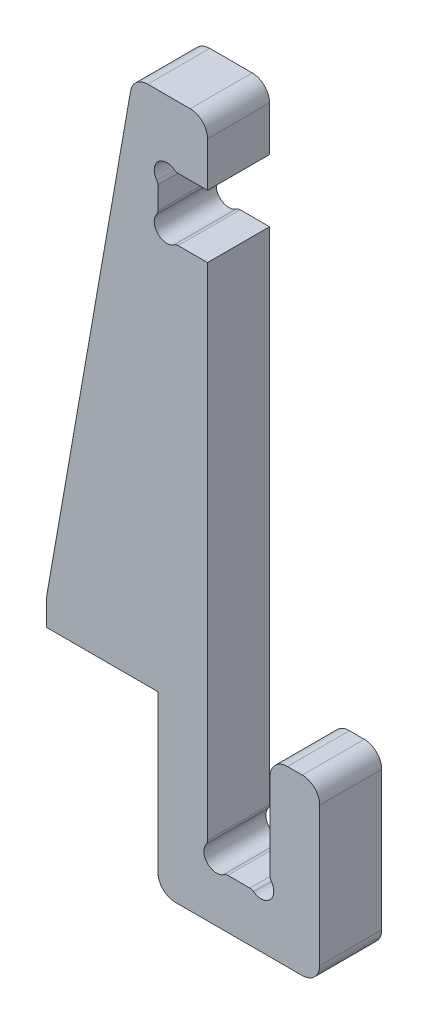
ISO-10303-21;
HEADER;
FILE_DESCRIPTION(('STEP AP214'),'2;1');
FILE_NAME('part.step','',(''),(''),'','','');
FILE_SCHEMA(('AUTOMOTIVE_DESIGN { 1 0 10303 214 1 1 1 1 }'));
ENDSEC;
DATA;
#1=APPLICATION_CONTEXT('core data for automotive mechanical design processes');
#2=APPLICATION_PROTOCOL_DEFINITION('international standard','automotive_design',2000,#1);
#3=PRODUCT_CONTEXT('',#1,'mechanical');
#4=PRODUCT('Part','Part','',(#3));
#5=PRODUCT_RELATED_PRODUCT_CATEGORY('part','',(#4));
#6=PRODUCT_DEFINITION_FORMATION('','',#4);
#7=PRODUCT_DEFINITION_CONTEXT('part definition',#1,'design');
#8=PRODUCT_DEFINITION('design','',#6,#7);
#9=PRODUCT_DEFINITION_SHAPE('','',#8);
#10=(LENGTH_UNIT() NAMED_UNIT(*) SI_UNIT(.MILLI.,.METRE.));
#11=(NAMED_UNIT(*) PLANE_ANGLE_UNIT() SI_UNIT($,.RADIAN.));
#12=(NAMED_UNIT(*) SI_UNIT($,.STERADIAN.) SOLID_ANGLE_UNIT());
#13=UNCERTAINTY_MEASURE_WITH_UNIT(LENGTH_MEASURE(1.E-05),#10,'distance_accuracy_value','');
#14=(GEOMETRIC_REPRESENTATION_CONTEXT(3) GLOBAL_UNCERTAINTY_ASSIGNED_CONTEXT((#13)) GLOBAL_UNIT_ASSIGNED_CONTEXT((#10,
#11,#12)) REPRESENTATION_CONTEXT('',''));
#15=CARTESIAN_POINT('',(0.,0.,0.));
#16=DIRECTION('',(0.,0.,1.));
#17=DIRECTION('',(1.,0.,0.));
#18=AXIS2_PLACEMENT_3D('',#15,#16,#17);
#19=CARTESIAN_POINT('',(17.5,28.1310403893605,25.));
#20=DIRECTION('',(0.,0.,-1.));
#21=DIRECTION('',(-1.,0.,0.));
#22=AXIS2_PLACEMENT_3D('',#19,#20,#21);
#23=CYLINDRICAL_SURFACE('',#22,2.5);
#24=CARTESIAN_POINT('',(17.5,28.1310403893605,0.));
#25=DIRECTION('',(0.,0.,1.));
#26=DIRECTION('',(1.,0.,0.));
#27=AXIS2_PLACEMENT_3D('',#24,#25,#26);
#28=CIRCLE('',#27,2.5);
#29=CARTESIAN_POINT('',(19.508633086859,26.6426207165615,0.));
#30=VERTEX_POINT('',#29);
#31=CARTESIAN_POINT('',(20.,28.1310403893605,0.));
#32=VERTEX_POINT('',#31);
#33=EDGE_CURVE('E273',#30,#32,#28,.T.);
#34=ORIENTED_EDGE('',*,*,#33,.T.);
#35=DIRECTION('',(0.,0.,-1.));
#36=VECTOR('',#35,1.);
#37=CARTESIAN_POINT('',(20.,28.1310403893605,25.));
#38=LINE('',#37,#36);
#39=CARTESIAN_POINT('',(20.,28.1310403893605,25.));
#40=VERTEX_POINT('',#39);
#41=EDGE_CURVE('E254',#40,#32,#38,.T.);
#42=ORIENTED_EDGE('',*,*,#41,.F.);
#43=CARTESIAN_POINT('',(17.5,28.1310403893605,25.));
#44=DIRECTION('',(0.,0.,1.));
#45=DIRECTION('',(1.,0.,0.));
#46=AXIS2_PLACEMENT_3D('',#43,#44,#45);
#47=CIRCLE('',#46,2.5);
#48=CARTESIAN_POINT('',(19.508633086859,26.6426207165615,25.));
#49=VERTEX_POINT('',#48);
#50=EDGE_CURVE('E260',#49,#40,#47,.T.);
#51=ORIENTED_EDGE('',*,*,#50,.F.);
#52=DIRECTION('',(0.,0.,-1.));
#53=VECTOR('',#52,1.);
#54=CARTESIAN_POINT('',(19.508633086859,26.6426207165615,25.));
#55=LINE('',#54,#53);
#56=EDGE_CURVE('E391',#49,#30,#55,.T.);
#57=ORIENTED_EDGE('',*,*,#56,.T.);
#58=EDGE_LOOP('',(#34,#42,#51,#57));
#59=FACE_BOUND('',#58,.T.);
#60=ADVANCED_FACE('F33',(#59),#23,.T.);
#61=CARTESIAN_POINT('',(20.,229.8,25.));
#62=DIRECTION('',(-1.,0.,0.));
#63=DIRECTION('',(0.,-1.,0.));
#64=AXIS2_PLACEMENT_3D('',#61,#62,#63);
#65=PLANE('',#64);
#66=DIRECTION('',(0.,1.,0.));
#67=VECTOR('',#66,1.);
#68=CARTESIAN_POINT('',(20.,229.8,0.));
#69=LINE('',#68,#67);
#70=CARTESIAN_POINT('',(20.,229.8,0.));
#71=VERTEX_POINT('',#70);
#72=EDGE_CURVE('E460',#32,#71,#69,.T.);
#73=ORIENTED_EDGE('',*,*,#72,.T.);
#74=DIRECTION('',(0.,0.,-1.));
#75=VECTOR('',#74,1.);
#76=CARTESIAN_POINT('',(20.,229.8,25.));
#77=LINE('',#76,#75);
#78=CARTESIAN_POINT('',(20.,229.8,25.));
#79=VERTEX_POINT('',#78);
#80=EDGE_CURVE('E257',#79,#71,#77,.T.);
#81=ORIENTED_EDGE('',*,*,#80,.F.);
#82=DIRECTION('',(0.,1.,0.));
#83=VECTOR('',#82,1.);
#84=CARTESIAN_POINT('',(20.,229.8,25.));
#85=LINE('',#84,#83);
#86=EDGE_CURVE('E250',#40,#79,#85,.T.);
#87=ORIENTED_EDGE('',*,*,#86,.F.);
#88=ORIENTED_EDGE('',*,*,#41,.T.);
#89=EDGE_LOOP('',(#73,#81,#87,#88));
#90=FACE_BOUND('',#89,.T.);
#91=ADVANCED_FACE('F252',(#90),#65,.F.);
#92=CARTESIAN_POINT('',(20.,229.8,25.));
#93=DIRECTION('',(0.,-1.,0.));
#94=DIRECTION('',(0.,0.,-1.));
#95=AXIS2_PLACEMENT_3D('',#92,#93,#94);
#96=PLANE('',#95);
#97=DIRECTION('',(-1.,0.,0.));
#98=VECTOR('',#97,1.);
#99=CARTESIAN_POINT('',(20.,229.8,0.));
#100=LINE('',#99,#98);
#101=CARTESIAN_POINT('',(8.13104038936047,229.8,0.));
#102=VERTEX_POINT('',#101);
#103=EDGE_CURVE('E454',#71,#102,#100,.T.);
#104=ORIENTED_EDGE('',*,*,#103,.T.);
#105=DIRECTION('',(0.,0.,-1.));
#106=VECTOR('',#105,1.);
#107=CARTESIAN_POINT('',(8.13104038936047,229.8,25.));
#108=LINE('',#107,#106);
#109=CARTESIAN_POINT('',(8.13104038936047,229.8,25.));
#110=VERTEX_POINT('',#109);
#111=EDGE_CURVE('E279',#110,#102,#108,.T.);
#112=ORIENTED_EDGE('',*,*,#111,.F.);
#113=DIRECTION('',(-1.,0.,0.));
#114=VECTOR('',#113,1.);
#115=CARTESIAN_POINT('',(20.,229.8,25.));
#116=LINE('',#115,#114);
#117=EDGE_CURVE('E259',#79,#110,#116,.T.);
#118=ORIENTED_EDGE('',*,*,#117,.F.);
#119=ORIENTED_EDGE('',*,*,#80,.T.);
#120=EDGE_LOOP('',(#104,#112,#118,#119));
#121=FACE_BOUND('',#120,.T.);
#122=ADVANCED_FACE('F548',(#121),#96,.F.);
#123=CARTESIAN_POINT('',(8.13104038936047,227.3,25.));
#124=DIRECTION('',(0.,0.,-1.));
#125=DIRECTION('',(-1.,0.,0.));
#126=AXIS2_PLACEMENT_3D('',#123,#124,#125);
#127=CYLINDRICAL_SURFACE('',#126,2.49999999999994);
#128=CARTESIAN_POINT('',(8.13104038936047,227.3,0.));
#129=DIRECTION('',(0.,0.,1.));
#130=DIRECTION('',(-1.,0.,0.));
#131=AXIS2_PLACEMENT_3D('',#128,#129,#130);
#132=CIRCLE('',#131,2.49999999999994);
#133=CARTESIAN_POINT('',(6.64262071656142,229.308633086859,0.));
#134=VERTEX_POINT('',#133);
#135=EDGE_CURVE('E449',#102,#134,#132,.T.);
#136=ORIENTED_EDGE('',*,*,#135,.T.);
#137=DIRECTION('',(0.,0.,-1.));
#138=VECTOR('',#137,1.);
#139=CARTESIAN_POINT('',(6.64262071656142,229.308633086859,25.));
#140=LINE('',#139,#138);
#141=CARTESIAN_POINT('',(6.64262071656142,229.308633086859,25.));
#142=VERTEX_POINT('',#141);
#143=EDGE_CURVE('E440',#142,#134,#140,.T.);
#144=ORIENTED_EDGE('',*,*,#143,.F.);
#145=CARTESIAN_POINT('',(8.13104038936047,227.3,25.));
#146=DIRECTION('',(0.,0.,1.));
#147=DIRECTION('',(-1.,0.,0.));
#148=AXIS2_PLACEMENT_3D('',#145,#146,#147);
#149=CIRCLE('',#148,2.49999999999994);
#150=EDGE_CURVE('E450',#110,#142,#149,.T.);
#151=ORIENTED_EDGE('',*,*,#150,.F.);
#152=ORIENTED_EDGE('',*,*,#111,.T.);
#153=EDGE_LOOP('',(#136,#144,#151,#152));
#154=FACE_BOUND('',#153,.T.);
#155=ADVANCED_FACE('F447',(#154),#127,.T.);
#156=CARTESIAN_POINT('',(3.60624458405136,233.406244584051,25.));
#157=DIRECTION('',(0.,0.,-1.));
#158=DIRECTION('',(-1.,0.,0.));
#159=AXIS2_PLACEMENT_3D('',#156,#157,#158);
#160=CYLINDRICAL_SURFACE('',#159,5.10000000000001);
#161=CARTESIAN_POINT('',(3.60624458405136,233.406244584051,0.));
#162=DIRECTION('',(0.,0.,-1.));
#163=DIRECTION('',(-1.,0.,0.));
#164=AXIS2_PLACEMENT_3D('',#161,#162,#163);
#165=CIRCLE('',#164,5.10000000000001);
#166=CARTESIAN_POINT('',(-0.49136691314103,236.442620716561,0.));
#167=VERTEX_POINT('',#166);
#168=EDGE_CURVE('E456',#134,#167,#165,.T.);
#169=ORIENTED_EDGE('',*,*,#168,.T.);
#170=DIRECTION('',(0.,0.,-1.));
#171=VECTOR('',#170,1.);
#172=CARTESIAN_POINT('',(-0.49136691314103,236.442620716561,25.));
#173=LINE('',#172,#171);
#174=CARTESIAN_POINT('',(-0.49136691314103,236.442620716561,25.));
#175=VERTEX_POINT('',#174);
#176=EDGE_CURVE('E437',#175,#167,#173,.T.);
#177=ORIENTED_EDGE('',*,*,#176,.F.);
#178=CARTESIAN_POINT('',(3.60624458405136,233.406244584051,25.));
#179=DIRECTION('',(0.,0.,-1.));
#180=DIRECTION('',(-1.,0.,0.));
#181=AXIS2_PLACEMENT_3D('',#178,#179,#180);
#182=CIRCLE('',#181,5.10000000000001);
#183=EDGE_CURVE('E508',#142,#175,#182,.T.);
#184=ORIENTED_EDGE('',*,*,#183,.F.);
#185=ORIENTED_EDGE('',*,*,#143,.T.);
#186=EDGE_LOOP('',(#169,#177,#184,#185));
#187=FACE_BOUND('',#186,.T.);
#188=ADVANCED_FACE('F507',(#187),#160,.F.);
#189=CARTESIAN_POINT('',(-2.50000000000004,237.931040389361,25.));
#190=DIRECTION('',(0.,0.,-1.));
#191=DIRECTION('',(-1.,0.,0.));
#192=AXIS2_PLACEMENT_3D('',#189,#190,#191);
#193=CYLINDRICAL_SURFACE('',#192,2.5);
#194=CARTESIAN_POINT('',(-2.50000000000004,237.931040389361,0.));
#195=DIRECTION('',(0.,0.,1.));
#196=DIRECTION('',(1.,0.,0.));
#197=AXIS2_PLACEMENT_3D('',#194,#195,#196);
#198=CIRCLE('',#197,2.5);
#199=CARTESIAN_POINT('',(0.,237.931040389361,0.));
#200=VERTEX_POINT('',#199);
#201=EDGE_CURVE('E458',#167,#200,#198,.T.);
#202=ORIENTED_EDGE('',*,*,#201,.T.);
#203=DIRECTION('',(0.,0.,-1.));
#204=VECTOR('',#203,1.);
#205=CARTESIAN_POINT('',(0.,237.931040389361,25.));
#206=LINE('',#205,#204);
#207=CARTESIAN_POINT('',(0.,237.931040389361,25.));
#208=VERTEX_POINT('',#207);
#209=EDGE_CURVE('E434',#208,#200,#206,.T.);
#210=ORIENTED_EDGE('',*,*,#209,.F.);
#211=CARTESIAN_POINT('',(-2.50000000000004,237.931040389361,25.));
#212=DIRECTION('',(0.,0.,1.));
#213=DIRECTION('',(1.,0.,0.));
#214=AXIS2_PLACEMENT_3D('',#211,#212,#213);
#215=CIRCLE('',#214,2.5);
#216=EDGE_CURVE('E503',#175,#208,#215,.T.);
#217=ORIENTED_EDGE('',*,*,#216,.F.);
#218=ORIENTED_EDGE('',*,*,#176,.T.);
#219=EDGE_LOOP('',(#202,#210,#217,#218));
#220=FACE_BOUND('',#219,.T.);
#221=ADVANCED_FACE('F502',(#220),#193,.T.);
#222=CARTESIAN_POINT('',(0.,246.868959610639,25.));
#223=DIRECTION('',(-1.,0.,0.));
#224=DIRECTION('',(0.,0.,1.));
#225=AXIS2_PLACEMENT_3D('',#222,#223,#224);
#226=PLANE('',#225);
#227=DIRECTION('',(0.,1.,0.));
#228=VECTOR('',#227,1.);
#229=CARTESIAN_POINT('',(0.,246.868959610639,0.));
#230=LINE('',#229,#228);
#231=CARTESIAN_POINT('',(0.,246.868959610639,0.));
#232=VERTEX_POINT('',#231);
#233=EDGE_CURVE('E465',#200,#232,#230,.T.);
#234=ORIENTED_EDGE('',*,*,#233,.T.);
#235=DIRECTION('',(0.,0.,-1.));
#236=VECTOR('',#235,1.);
#237=CARTESIAN_POINT('',(0.,246.868959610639,25.));
#238=LINE('',#237,#236);
#239=CARTESIAN_POINT('',(0.,246.868959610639,25.));
#240=VERTEX_POINT('',#239);
#241=EDGE_CURVE('E431',#240,#232,#238,.T.);
#242=ORIENTED_EDGE('',*,*,#241,.F.);
#243=DIRECTION('',(0.,1.,0.));
#244=VECTOR('',#243,1.);
#245=CARTESIAN_POINT('',(0.,246.868959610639,25.));
#246=LINE('',#245,#244);
#247=EDGE_CURVE('E499',#208,#240,#246,.T.);
#248=ORIENTED_EDGE('',*,*,#247,.F.);
#249=ORIENTED_EDGE('',*,*,#209,.T.);
#250=EDGE_LOOP('',(#234,#242,#248,#249));
#251=FACE_BOUND('',#250,.T.);
#252=ADVANCED_FACE('F496',(#251),#226,.F.);
#253=CARTESIAN_POINT('',(-2.50000000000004,246.868959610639,25.));
#254=DIRECTION('',(0.,0.,-1.));
#255=DIRECTION('',(-1.,0.,0.));
#256=AXIS2_PLACEMENT_3D('',#253,#254,#255);
#257=CYLINDRICAL_SURFACE('',#256,2.5);
#258=CARTESIAN_POINT('',(-2.50000000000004,246.868959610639,0.));
#259=DIRECTION('',(0.,0.,1.));
#260=DIRECTION('',(-1.,0.,0.));
#261=AXIS2_PLACEMENT_3D('',#258,#259,#260);
#262=CIRCLE('',#261,2.5);
#263=CARTESIAN_POINT('',(-0.491366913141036,248.357379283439,0.));
#264=VERTEX_POINT('',#263);
#265=EDGE_CURVE('E467',#232,#264,#262,.T.);
#266=ORIENTED_EDGE('',*,*,#265,.T.);
#267=DIRECTION('',(0.,0.,-1.));
#268=VECTOR('',#267,1.);
#269=CARTESIAN_POINT('',(-0.491366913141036,248.357379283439,25.));
#270=LINE('',#269,#268);
#271=CARTESIAN_POINT('',(-0.491366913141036,248.357379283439,25.));
#272=VERTEX_POINT('',#271);
#273=EDGE_CURVE('E428',#272,#264,#270,.T.);
#274=ORIENTED_EDGE('',*,*,#273,.F.);
#275=CARTESIAN_POINT('',(-2.50000000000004,246.868959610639,25.));
#276=DIRECTION('',(0.,0.,1.));
#277=DIRECTION('',(-1.,0.,0.));
#278=AXIS2_PLACEMENT_3D('',#275,#276,#277);
#279=CIRCLE('',#278,2.5);
#280=EDGE_CURVE('E492',#240,#272,#279,.T.);
#281=ORIENTED_EDGE('',*,*,#280,.F.);
#282=ORIENTED_EDGE('',*,*,#241,.T.);
#283=EDGE_LOOP('',(#266,#274,#281,#282));
#284=FACE_BOUND('',#283,.T.);
#285=ADVANCED_FACE('F491',(#284),#257,.T.);
#286=CARTESIAN_POINT('',(3.60624458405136,251.393755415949,25.));
#287=DIRECTION('',(0.,0.,-1.));
#288=DIRECTION('',(-1.,0.,0.));
#289=AXIS2_PLACEMENT_3D('',#286,#287,#288);
#290=CYLINDRICAL_SURFACE('',#289,5.10000000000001);
#291=CARTESIAN_POINT('',(3.60624458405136,251.393755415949,0.));
#292=DIRECTION('',(0.,0.,-1.));
#293=DIRECTION('',(1.,0.,0.));
#294=AXIS2_PLACEMENT_3D('',#291,#292,#293);
#295=CIRCLE('',#294,5.10000000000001);
#296=CARTESIAN_POINT('',(6.64262071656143,255.491366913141,0.));
#297=VERTEX_POINT('',#296);
#298=EDGE_CURVE('E469',#264,#297,#295,.T.);
#299=ORIENTED_EDGE('',*,*,#298,.T.);
#300=DIRECTION('',(0.,0.,-1.));
#301=VECTOR('',#300,1.);
#302=CARTESIAN_POINT('',(6.64262071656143,255.491366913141,25.));
#303=LINE('',#302,#301);
#304=CARTESIAN_POINT('',(6.64262071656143,255.491366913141,25.));
#305=VERTEX_POINT('',#304);
#306=EDGE_CURVE('E425',#305,#297,#303,.T.);
#307=ORIENTED_EDGE('',*,*,#306,.F.);
#308=CARTESIAN_POINT('',(3.60624458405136,251.393755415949,25.));
#309=DIRECTION('',(0.,0.,-1.));
#310=DIRECTION('',(1.,0.,0.));
#311=AXIS2_PLACEMENT_3D('',#308,#309,#310);
#312=CIRCLE('',#311,5.10000000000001);
#313=EDGE_CURVE('E487',#272,#305,#312,.T.);
#314=ORIENTED_EDGE('',*,*,#313,.F.);
#315=ORIENTED_EDGE('',*,*,#273,.T.);
#316=EDGE_LOOP('',(#299,#307,#314,#315));
#317=FACE_BOUND('',#316,.T.);
#318=ADVANCED_FACE('F486',(#317),#290,.F.);
#319=CARTESIAN_POINT('',(8.13104038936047,257.5,25.));
#320=DIRECTION('',(0.,0.,-1.));
#321=DIRECTION('',(-1.,0.,0.));
#322=AXIS2_PLACEMENT_3D('',#319,#320,#321);
#323=CYLINDRICAL_SURFACE('',#322,2.49999999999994);
#324=CARTESIAN_POINT('',(8.13104038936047,257.5,0.));
#325=DIRECTION('',(0.,0.,1.));
#326=DIRECTION('',(1.,0.,0.));
#327=AXIS2_PLACEMENT_3D('',#324,#325,#326);
#328=CIRCLE('',#327,2.49999999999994);
#329=CARTESIAN_POINT('',(8.13104038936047,255.,0.));
#330=VERTEX_POINT('',#329);
#331=EDGE_CURVE('E471',#297,#330,#328,.T.);
#332=ORIENTED_EDGE('',*,*,#331,.T.);
#333=DIRECTION('',(0.,0.,-1.));
#334=VECTOR('',#333,1.);
#335=CARTESIAN_POINT('',(8.13104038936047,255.,25.));
#336=LINE('',#335,#334);
#337=CARTESIAN_POINT('',(8.13104038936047,255.,25.));
#338=VERTEX_POINT('',#337);
#339=EDGE_CURVE('E422',#338,#330,#336,.T.);
#340=ORIENTED_EDGE('',*,*,#339,.F.);
#341=CARTESIAN_POINT('',(8.13104038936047,257.5,25.));
#342=DIRECTION('',(0.,0.,1.));
#343=DIRECTION('',(1.,0.,0.));
#344=AXIS2_PLACEMENT_3D('',#341,#342,#343);
#345=CIRCLE('',#344,2.49999999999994);
#346=EDGE_CURVE('E483',#305,#338,#345,.T.);
#347=ORIENTED_EDGE('',*,*,#346,.F.);
#348=ORIENTED_EDGE('',*,*,#306,.T.);
#349=EDGE_LOOP('',(#332,#340,#347,#348));
#350=FACE_BOUND('',#349,.T.);
#351=ADVANCED_FACE('F480',(#350),#323,.T.);
#352=CARTESIAN_POINT('',(20.,255.,25.));
#353=DIRECTION('',(0.,1.,0.));
#354=DIRECTION('',(0.,0.,1.));
#355=AXIS2_PLACEMENT_3D('',#352,#353,#354);
#356=PLANE('',#355);
#357=DIRECTION('',(1.,0.,0.));
#358=VECTOR('',#357,1.);
#359=CARTESIAN_POINT('',(20.,255.,0.));
#360=LINE('',#359,#358);
#361=CARTESIAN_POINT('',(20.,255.,0.));
#362=VERTEX_POINT('',#361);
#363=EDGE_CURVE('E360',#330,#362,#360,.T.);
#364=ORIENTED_EDGE('',*,*,#363,.T.);
#365=DIRECTION('',(0.,0.,-1.));
#366=VECTOR('',#365,1.);
#367=CARTESIAN_POINT('',(20.,255.,25.));
#368=LINE('',#367,#366);
#369=CARTESIAN_POINT('',(20.,255.,25.));
#370=VERTEX_POINT('',#369);
#371=EDGE_CURVE('E420',#370,#362,#368,.T.);
#372=ORIENTED_EDGE('',*,*,#371,.F.);
#373=DIRECTION('',(1.,0.,0.));
#374=VECTOR('',#373,1.);
#375=CARTESIAN_POINT('',(20.,255.,25.));
#376=LINE('',#375,#374);
#377=EDGE_CURVE('E340',#338,#370,#376,.T.);
#378=ORIENTED_EDGE('',*,*,#377,.F.);
#379=ORIENTED_EDGE('',*,*,#339,.T.);
#380=EDGE_LOOP('',(#364,#372,#378,#379));
#381=FACE_BOUND('',#380,.T.);
#382=ADVANCED_FACE('F474',(#381),#356,.F.);
#383=CARTESIAN_POINT('',(20.,280.,25.));
#384=DIRECTION('',(-1.,0.,0.));
#385=DIRECTION('',(0.,0.,1.));
#386=AXIS2_PLACEMENT_3D('',#383,#384,#385);
#387=PLANE('',#386);
#388=DIRECTION('',(0.,1.,0.));
#389=VECTOR('',#388,1.);
#390=CARTESIAN_POINT('',(20.,280.,0.));
#391=LINE('',#390,#389);
#392=CARTESIAN_POINT('',(20.,273.,0.));
#393=VERTEX_POINT('',#392);
#394=EDGE_CURVE('E334',#362,#393,#391,.T.);
#395=ORIENTED_EDGE('',*,*,#394,.T.);
#396=DIRECTION('',(0.,0.,-1.));
#397=VECTOR('',#396,1.);
#398=CARTESIAN_POINT('',(20.,273.,25.));
#399=LINE('',#398,#397);
#400=CARTESIAN_POINT('',(20.,273.,25.));
#401=VERTEX_POINT('',#400);
#402=EDGE_CURVE('E41',#393,#401,#399,.F.);
#403=ORIENTED_EDGE('',*,*,#402,.T.);
#404=DIRECTION('',(0.,1.,0.));
#405=VECTOR('',#404,1.);
#406=CARTESIAN_POINT('',(20.,280.,25.));
#407=LINE('',#406,#405);
#408=EDGE_CURVE('E332',#370,#401,#407,.T.);
#409=ORIENTED_EDGE('',*,*,#408,.F.);
#410=ORIENTED_EDGE('',*,*,#371,.T.);
#411=EDGE_LOOP('',(#395,#403,#409,#410));
#412=FACE_BOUND('',#411,.T.);
#413=ADVANCED_FACE('F330',(#412),#387,.F.);
#414=CARTESIAN_POINT('',(-10.,280.,25.));
#415=DIRECTION('',(0.,-1.,0.));
#416=DIRECTION('',(0.,0.,-1.));
#417=AXIS2_PLACEMENT_3D('',#414,#415,#416);
#418=PLANE('',#417);
#419=DIRECTION('',(-1.,0.,0.));
#420=VECTOR('',#419,1.);
#421=CARTESIAN_POINT('',(-10.,280.,25.));
#422=LINE('',#421,#420);
#423=CARTESIAN_POINT('',(13.,280.,25.));
#424=VERTEX_POINT('',#423);
#425=CARTESIAN_POINT('',(-4.11862082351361,280.,25.));
#426=VERTEX_POINT('',#425);
#427=EDGE_CURVE('E342',#424,#426,#422,.T.);
#428=ORIENTED_EDGE('',*,*,#427,.F.);
#429=DIRECTION('',(0.,0.,-1.));
#430=VECTOR('',#429,1.);
#431=CARTESIAN_POINT('',(13.,280.,25.));
#432=LINE('',#431,#430);
#433=CARTESIAN_POINT('',(13.,280.,0.));
#434=VERTEX_POINT('',#433);
#435=EDGE_CURVE('E323',#424,#434,#432,.T.);
#436=ORIENTED_EDGE('',*,*,#435,.T.);
#437=DIRECTION('',(-1.,0.,0.));
#438=VECTOR('',#437,1.);
#439=CARTESIAN_POINT('',(-10.,280.,0.));
#440=LINE('',#439,#438);
#441=CARTESIAN_POINT('',(-4.11862082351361,280.,0.));
#442=VERTEX_POINT('',#441);
#443=EDGE_CURVE('E350',#434,#442,#440,.T.);
#444=ORIENTED_EDGE('',*,*,#443,.T.);
#445=DIRECTION('',(0.,0.,-1.));
#446=VECTOR('',#445,1.);
#447=CARTESIAN_POINT('',(-4.11862082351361,280.,25.));
#448=LINE('',#447,#446);
#449=EDGE_CURVE('E321',#442,#426,#448,.F.);
#450=ORIENTED_EDGE('',*,*,#449,.T.);
#451=EDGE_LOOP('',(#428,#436,#444,#450));
#452=FACE_BOUND('',#451,.T.);
#453=ADVANCED_FACE('F349',(#452),#418,.F.);
#454=CARTESIAN_POINT('',(-45.,80.,25.));
#455=DIRECTION('',(0.985030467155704,-0.172380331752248,0.));
#456=DIRECTION('',(0.172380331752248,0.985030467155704,0.));
#457=AXIS2_PLACEMENT_3D('',#454,#455,#456);
#458=PLANE('',#457);
#459=DIRECTION('',(-0.172380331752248,-0.985030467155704,0.));
#460=VECTOR('',#459,1.);
#461=CARTESIAN_POINT('',(-45.,80.,25.));
#462=LINE('',#461,#460);
#463=CARTESIAN_POINT('',(-11.0138340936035,274.206662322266,25.));
#464=VERTEX_POINT('',#463);
#465=CARTESIAN_POINT('',(-45.,80.,25.));
#466=VERTEX_POINT('',#465);
#467=EDGE_CURVE('E520',#464,#466,#462,.T.);
#468=ORIENTED_EDGE('',*,*,#467,.F.);
#469=DIRECTION('',(0.,0.,-1.));
#470=VECTOR('',#469,1.);
#471=CARTESIAN_POINT('',(-11.0138340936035,274.206662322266,25.));
#472=LINE('',#471,#470);
#473=CARTESIAN_POINT('',(-11.0138340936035,274.206662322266,0.));
#474=VERTEX_POINT('',#473);
#475=EDGE_CURVE('E11',#464,#474,#472,.T.);
#476=ORIENTED_EDGE('',*,*,#475,.T.);
#477=DIRECTION('',(-0.172380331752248,-0.985030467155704,0.));
#478=VECTOR('',#477,1.);
#479=CARTESIAN_POINT('',(-45.,80.,0.));
#480=LINE('',#479,#478);
#481=CARTESIAN_POINT('',(-45.,80.,0.));
#482=VERTEX_POINT('',#481);
#483=EDGE_CURVE('E356',#474,#482,#480,.T.);
#484=ORIENTED_EDGE('',*,*,#483,.T.);
#485=DIRECTION('',(0.,0.,-1.));
#486=VECTOR('',#485,1.);
#487=CARTESIAN_POINT('',(-45.,80.,25.));
#488=LINE('',#487,#486);
#489=EDGE_CURVE('E417',#466,#482,#488,.T.);
#490=ORIENTED_EDGE('',*,*,#489,.F.);
#491=EDGE_LOOP('',(#468,#476,#484,#490));
#492=FACE_BOUND('',#491,.T.);
#493=ADVANCED_FACE('F589',(#492),#458,.F.);
#494=CARTESIAN_POINT('',(-45.,70.,25.));
#495=DIRECTION('',(1.,0.,0.));
#496=DIRECTION('',(0.,1.,0.));
#497=AXIS2_PLACEMENT_3D('',#494,#495,#496);
#498=PLANE('',#497);
#499=DIRECTION('',(0.,-1.,0.));
#500=VECTOR('',#499,1.);
#501=CARTESIAN_POINT('',(-45.,70.,0.));
#502=LINE('',#501,#500);
#503=CARTESIAN_POINT('',(-45.,70.,0.));
#504=VERTEX_POINT('',#503);
#505=EDGE_CURVE('E358',#482,#504,#502,.T.);
#506=ORIENTED_EDGE('',*,*,#505,.T.);
#507=DIRECTION('',(0.,0.,-1.));
#508=VECTOR('',#507,1.);
#509=CARTESIAN_POINT('',(-45.,70.,25.));
#510=LINE('',#509,#508);
#511=CARTESIAN_POINT('',(-45.,70.,25.));
#512=VERTEX_POINT('',#511);
#513=EDGE_CURVE('E414',#512,#504,#510,.T.);
#514=ORIENTED_EDGE('',*,*,#513,.F.);
#515=DIRECTION('',(0.,-1.,0.));
#516=VECTOR('',#515,1.);
#517=CARTESIAN_POINT('',(-45.,70.,25.));
#518=LINE('',#517,#516);
#519=EDGE_CURVE('E522',#466,#512,#518,.T.);
#520=ORIENTED_EDGE('',*,*,#519,.F.);
#521=ORIENTED_EDGE('',*,*,#489,.T.);
#522=EDGE_LOOP('',(#506,#514,#520,#521));
#523=FACE_BOUND('',#522,.T.);
#524=ADVANCED_FACE('F594',(#523),#498,.F.);
#525=CARTESIAN_POINT('',(0.,70.,25.));
#526=DIRECTION('',(0.,1.,0.));
#527=DIRECTION('',(0.,0.,1.));
#528=AXIS2_PLACEMENT_3D('',#525,#526,#527);
#529=PLANE('',#528);
#530=DIRECTION('',(1.,0.,0.));
#531=VECTOR('',#530,1.);
#532=CARTESIAN_POINT('',(0.,70.,0.));
#533=LINE('',#532,#531);
#534=CARTESIAN_POINT('',(0.,70.,0.));
#535=VERTEX_POINT('',#534);
#536=EDGE_CURVE('E365',#504,#535,#533,.T.);
#537=ORIENTED_EDGE('',*,*,#536,.T.);
#538=DIRECTION('',(0.,0.,-1.));
#539=VECTOR('',#538,1.);
#540=CARTESIAN_POINT('',(0.,70.,25.));
#541=LINE('',#540,#539);
#542=CARTESIAN_POINT('',(0.,70.,25.));
#543=VERTEX_POINT('',#542);
#544=EDGE_CURVE('E411',#543,#535,#541,.T.);
#545=ORIENTED_EDGE('',*,*,#544,.F.);
#546=DIRECTION('',(1.,0.,0.));
#547=VECTOR('',#546,1.);
#548=CARTESIAN_POINT('',(0.,70.,25.));
#549=LINE('',#548,#547);
#550=EDGE_CURVE('E524',#512,#543,#549,.T.);
#551=ORIENTED_EDGE('',*,*,#550,.F.);
#552=ORIENTED_EDGE('',*,*,#513,.T.);
#553=EDGE_LOOP('',(#537,#545,#551,#552));
#554=FACE_BOUND('',#553,.T.);
#555=ADVANCED_FACE('F600',(#554),#529,.F.);
#556=CARTESIAN_POINT('',(0.,0.,25.));
#557=DIRECTION('',(1.,0.,0.));
#558=DIRECTION('',(0.,1.,0.));
#559=AXIS2_PLACEMENT_3D('',#556,#557,#558);
#560=PLANE('',#559);
#561=DIRECTION('',(0.,-1.,0.));
#562=VECTOR('',#561,1.);
#563=CARTESIAN_POINT('',(0.,0.,0.));
#564=LINE('',#563,#562);
#565=CARTESIAN_POINT('',(0.,7.,0.));
#566=VERTEX_POINT('',#565);
#567=EDGE_CURVE('E367',#535,#566,#564,.T.);
#568=ORIENTED_EDGE('',*,*,#567,.T.);
#569=DIRECTION('',(0.,0.,-1.));
#570=VECTOR('',#569,1.);
#571=CARTESIAN_POINT('',(0.,7.,25.));
#572=LINE('',#571,#570);
#573=CARTESIAN_POINT('',(0.,7.,25.));
#574=VERTEX_POINT('',#573);
#575=EDGE_CURVE('E319',#566,#574,#572,.F.);
#576=ORIENTED_EDGE('',*,*,#575,.T.);
#577=DIRECTION('',(0.,-1.,0.));
#578=VECTOR('',#577,1.);
#579=CARTESIAN_POINT('',(0.,0.,25.));
#580=LINE('',#579,#578);
#581=EDGE_CURVE('E526',#543,#574,#580,.T.);
#582=ORIENTED_EDGE('',*,*,#581,.F.);
#583=ORIENTED_EDGE('',*,*,#544,.T.);
#584=EDGE_LOOP('',(#568,#576,#582,#583));
#585=FACE_BOUND('',#584,.T.);
#586=ADVANCED_FACE('F604',(#585),#560,.F.);
#587=CARTESIAN_POINT('',(65.2,0.,25.));
#588=DIRECTION('',(0.,1.,0.));
#589=DIRECTION('',(-1.,0.,0.));
#590=AXIS2_PLACEMENT_3D('',#587,#588,#589);
#591=PLANE('',#590);
#592=DIRECTION('',(1.,0.,0.));
#593=VECTOR('',#592,1.);
#594=CARTESIAN_POINT('',(65.2,0.,0.));
#595=LINE('',#594,#593);
#596=CARTESIAN_POINT('',(7.,0.,0.));
#597=VERTEX_POINT('',#596);
#598=CARTESIAN_POINT('',(58.2,0.,0.));
#599=VERTEX_POINT('',#598);
#600=EDGE_CURVE('E370',#597,#599,#595,.T.);
#601=ORIENTED_EDGE('',*,*,#600,.T.);
#602=DIRECTION('',(0.,0.,-1.));
#603=VECTOR('',#602,1.);
#604=CARTESIAN_POINT('',(58.2,0.,25.));
#605=LINE('',#604,#603);
#606=CARTESIAN_POINT('',(58.2,0.,25.));
#607=VERTEX_POINT('',#606);
#608=EDGE_CURVE('E317',#599,#607,#605,.F.);
#609=ORIENTED_EDGE('',*,*,#608,.T.);
#610=DIRECTION('',(1.,0.,0.));
#611=VECTOR('',#610,1.);
#612=CARTESIAN_POINT('',(65.2,0.,25.));
#613=LINE('',#612,#611);
#614=CARTESIAN_POINT('',(7.,0.,25.));
#615=VERTEX_POINT('',#614);
#616=EDGE_CURVE('E529',#615,#607,#613,.T.);
#617=ORIENTED_EDGE('',*,*,#616,.F.);
#618=DIRECTION('',(0.,0.,-1.));
#619=VECTOR('',#618,1.);
#620=CARTESIAN_POINT('',(7.,0.,25.));
#621=LINE('',#620,#619);
#622=EDGE_CURVE('E314',#615,#597,#621,.T.);
#623=ORIENTED_EDGE('',*,*,#622,.T.);
#624=EDGE_LOOP('',(#601,#609,#617,#623));
#625=FACE_BOUND('',#624,.T.);
#626=ADVANCED_FACE('F609',(#625),#591,.F.);
#627=CARTESIAN_POINT('',(65.2,70.,25.));
#628=DIRECTION('',(-1.,0.,0.));
#629=DIRECTION('',(0.,-1.,0.));
#630=AXIS2_PLACEMENT_3D('',#627,#628,#629);
#631=PLANE('',#630);
#632=DIRECTION('',(0.,1.,0.));
#633=VECTOR('',#632,1.);
#634=CARTESIAN_POINT('',(65.2,70.,0.));
#635=LINE('',#634,#633);
#636=CARTESIAN_POINT('',(65.2,7.00000000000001,0.));
#637=VERTEX_POINT('',#636);
#638=CARTESIAN_POINT('',(65.2,63.,0.));
#639=VERTEX_POINT('',#638);
#640=EDGE_CURVE('E373',#637,#639,#635,.T.);
#641=ORIENTED_EDGE('',*,*,#640,.T.);
#642=DIRECTION('',(0.,0.,-1.));
#643=VECTOR('',#642,1.);
#644=CARTESIAN_POINT('',(65.2,63.,25.));
#645=LINE('',#644,#643);
#646=CARTESIAN_POINT('',(65.2,63.,25.));
#647=VERTEX_POINT('',#646);
#648=EDGE_CURVE('E48',#639,#647,#645,.F.);
#649=ORIENTED_EDGE('',*,*,#648,.T.);
#650=DIRECTION('',(0.,1.,0.));
#651=VECTOR('',#650,1.);
#652=CARTESIAN_POINT('',(65.2,70.,25.));
#653=LINE('',#652,#651);
#654=CARTESIAN_POINT('',(65.2,7.00000000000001,25.));
#655=VERTEX_POINT('',#654);
#656=EDGE_CURVE('E531',#655,#647,#653,.T.);
#657=ORIENTED_EDGE('',*,*,#656,.F.);
#658=DIRECTION('',(0.,0.,-1.));
#659=VECTOR('',#658,1.);
#660=CARTESIAN_POINT('',(65.2,7.00000000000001,25.));
#661=LINE('',#660,#659);
#662=EDGE_CURVE('E310',#655,#637,#661,.T.);
#663=ORIENTED_EDGE('',*,*,#662,.T.);
#664=EDGE_LOOP('',(#641,#649,#657,#663));
#665=FACE_BOUND('',#664,.T.);
#666=ADVANCED_FACE('F614',(#665),#631,.F.);
#667=CARTESIAN_POINT('',(45.2,70.,25.));
#668=DIRECTION('',(0.,-1.,0.));
#669=DIRECTION('',(1.,0.,0.));
#670=AXIS2_PLACEMENT_3D('',#667,#668,#669);
#671=PLANE('',#670);
#672=DIRECTION('',(-1.,0.,0.));
#673=VECTOR('',#672,1.);
#674=CARTESIAN_POINT('',(45.2,70.,0.));
#675=LINE('',#674,#673);
#676=CARTESIAN_POINT('',(58.2,70.,0.));
#677=VERTEX_POINT('',#676);
#678=CARTESIAN_POINT('',(52.2,70.,0.));
#679=VERTEX_POINT('',#678);
#680=EDGE_CURVE('E375',#677,#679,#675,.T.);
#681=ORIENTED_EDGE('',*,*,#680,.T.);
#682=DIRECTION('',(0.,0.,-1.));
#683=VECTOR('',#682,1.);
#684=CARTESIAN_POINT('',(52.2,70.,25.));
#685=LINE('',#684,#683);
#686=CARTESIAN_POINT('',(52.2,70.,25.));
#687=VERTEX_POINT('',#686);
#688=EDGE_CURVE('E297',#679,#687,#685,.F.);
#689=ORIENTED_EDGE('',*,*,#688,.T.);
#690=DIRECTION('',(-1.,0.,0.));
#691=VECTOR('',#690,1.);
#692=CARTESIAN_POINT('',(45.2,70.,25.));
#693=LINE('',#692,#691);
#694=CARTESIAN_POINT('',(58.2,70.,25.));
#695=VERTEX_POINT('',#694);
#696=EDGE_CURVE('E533',#695,#687,#693,.T.);
#697=ORIENTED_EDGE('',*,*,#696,.F.);
#698=DIRECTION('',(0.,0.,-1.));
#699=VECTOR('',#698,1.);
#700=CARTESIAN_POINT('',(58.2,70.,25.));
#701=LINE('',#700,#699);
#702=EDGE_CURVE('E294',#695,#677,#701,.T.);
#703=ORIENTED_EDGE('',*,*,#702,.T.);
#704=EDGE_LOOP('',(#681,#689,#697,#703));
#705=FACE_BOUND('',#704,.T.);
#706=ADVANCED_FACE('F620',(#705),#671,.F.);
#707=CARTESIAN_POINT('',(45.2,70.,25.));
#708=DIRECTION('',(1.,0.,0.));
#709=DIRECTION('',(0.,0.,-1.));
#710=AXIS2_PLACEMENT_3D('',#707,#708,#709);
#711=PLANE('',#710);
#712=DIRECTION('',(0.,-1.,0.));
#713=VECTOR('',#712,1.);
#714=CARTESIAN_POINT('',(45.2,70.,25.));
#715=LINE('',#714,#713);
#716=CARTESIAN_POINT('',(45.2,63.,25.));
#717=VERTEX_POINT('',#716);
#718=CARTESIAN_POINT('',(45.2,28.1310403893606,25.));
#719=VERTEX_POINT('',#718);
#720=EDGE_CURVE('E535',#717,#719,#715,.T.);
#721=ORIENTED_EDGE('',*,*,#720,.F.);
#722=DIRECTION('',(0.,0.,-1.));
#723=VECTOR('',#722,1.);
#724=CARTESIAN_POINT('',(45.2,63.,25.));
#725=LINE('',#724,#723);
#726=CARTESIAN_POINT('',(45.2,63.,0.));
#727=VERTEX_POINT('',#726);
#728=EDGE_CURVE('E274',#717,#727,#725,.T.);
#729=ORIENTED_EDGE('',*,*,#728,.T.);
#730=DIRECTION('',(0.,-1.,0.));
#731=VECTOR('',#730,1.);
#732=CARTESIAN_POINT('',(45.2,70.,0.));
#733=LINE('',#732,#731);
#734=CARTESIAN_POINT('',(45.2,28.1310403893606,0.));
#735=VERTEX_POINT('',#734);
#736=EDGE_CURVE('E378',#727,#735,#733,.T.);
#737=ORIENTED_EDGE('',*,*,#736,.T.);
#738=DIRECTION('',(0.,0.,-1.));
#739=VECTOR('',#738,1.);
#740=CARTESIAN_POINT('',(45.2,28.1310403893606,25.));
#741=LINE('',#740,#739);
#742=EDGE_CURVE('E408',#719,#735,#741,.T.);
#743=ORIENTED_EDGE('',*,*,#742,.F.);
#744=EDGE_LOOP('',(#721,#729,#737,#743));
#745=FACE_BOUND('',#744,.T.);
#746=ADVANCED_FACE('F626',(#745),#711,.F.);
#747=CARTESIAN_POINT('',(47.7,28.1310403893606,25.));
#748=DIRECTION('',(0.,0.,-1.));
#749=DIRECTION('',(-1.,0.,0.));
#750=AXIS2_PLACEMENT_3D('',#747,#748,#749);
#751=CYLINDRICAL_SURFACE('',#750,2.5);
#752=CARTESIAN_POINT('',(47.7,28.1310403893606,0.));
#753=DIRECTION('',(0.,0.,1.));
#754=DIRECTION('',(-1.,0.,0.));
#755=AXIS2_PLACEMENT_3D('',#752,#753,#754);
#756=CIRCLE('',#755,2.5);
#757=CARTESIAN_POINT('',(45.691366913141,26.6426207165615,0.));
#758=VERTEX_POINT('',#757);
#759=EDGE_CURVE('E380',#735,#758,#756,.T.);
#760=ORIENTED_EDGE('',*,*,#759,.T.);
#761=DIRECTION('',(0.,0.,-1.));
#762=VECTOR('',#761,1.);
#763=CARTESIAN_POINT('',(45.691366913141,26.6426207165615,25.));
#764=LINE('',#763,#762);
#765=CARTESIAN_POINT('',(45.691366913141,26.6426207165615,25.));
#766=VERTEX_POINT('',#765);
#767=EDGE_CURVE('E405',#766,#758,#764,.T.);
#768=ORIENTED_EDGE('',*,*,#767,.F.);
#769=CARTESIAN_POINT('',(47.7,28.1310403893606,25.));
#770=DIRECTION('',(0.,0.,1.));
#771=DIRECTION('',(-1.,0.,0.));
#772=AXIS2_PLACEMENT_3D('',#769,#770,#771);
#773=CIRCLE('',#772,2.5);
#774=EDGE_CURVE('E537',#719,#766,#773,.T.);
#775=ORIENTED_EDGE('',*,*,#774,.F.);
#776=ORIENTED_EDGE('',*,*,#742,.T.);
#777=EDGE_LOOP('',(#760,#768,#775,#776));
#778=FACE_BOUND('',#777,.T.);
#779=ADVANCED_FACE('F633',(#778),#751,.T.);
#780=CARTESIAN_POINT('',(41.5937554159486,23.6062445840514,25.));
#781=DIRECTION('',(0.,0.,-1.));
#782=DIRECTION('',(-1.,0.,0.));
#783=AXIS2_PLACEMENT_3D('',#780,#781,#782);
#784=CYLINDRICAL_SURFACE('',#783,5.1);
#785=CARTESIAN_POINT('',(41.5937554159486,23.6062445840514,0.));
#786=DIRECTION('',(0.,0.,-1.));
#787=DIRECTION('',(-1.,0.,0.));
#788=AXIS2_PLACEMENT_3D('',#785,#786,#787);
#789=CIRCLE('',#788,5.1);
#790=CARTESIAN_POINT('',(38.5573792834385,19.508633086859,0.));
#791=VERTEX_POINT('',#790);
#792=EDGE_CURVE('E382',#758,#791,#789,.T.);
#793=ORIENTED_EDGE('',*,*,#792,.T.);
#794=DIRECTION('',(0.,0.,-1.));
#795=VECTOR('',#794,1.);
#796=CARTESIAN_POINT('',(38.5573792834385,19.508633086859,25.));
#797=LINE('',#796,#795);
#798=CARTESIAN_POINT('',(38.5573792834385,19.508633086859,25.));
#799=VERTEX_POINT('',#798);
#800=EDGE_CURVE('E402',#799,#791,#797,.T.);
#801=ORIENTED_EDGE('',*,*,#800,.F.);
#802=CARTESIAN_POINT('',(41.5937554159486,23.6062445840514,25.));
#803=DIRECTION('',(0.,0.,-1.));
#804=DIRECTION('',(-1.,0.,0.));
#805=AXIS2_PLACEMENT_3D('',#802,#803,#804);
#806=CIRCLE('',#805,5.1);
#807=EDGE_CURVE('E539',#766,#799,#806,.T.);
#808=ORIENTED_EDGE('',*,*,#807,.F.);
#809=ORIENTED_EDGE('',*,*,#767,.T.);
#810=EDGE_LOOP('',(#793,#801,#808,#809));
#811=FACE_BOUND('',#810,.T.);
#812=ADVANCED_FACE('F637',(#811),#784,.F.);
#813=CARTESIAN_POINT('',(37.0689596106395,17.5,25.));
#814=DIRECTION('',(0.,0.,-1.));
#815=DIRECTION('',(-1.,0.,0.));
#816=AXIS2_PLACEMENT_3D('',#813,#814,#815);
#817=CYLINDRICAL_SURFACE('',#816,2.5);
#818=CARTESIAN_POINT('',(37.0689596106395,17.5,0.));
#819=DIRECTION('',(0.,0.,1.));
#820=DIRECTION('',(1.,0.,0.));
#821=AXIS2_PLACEMENT_3D('',#818,#819,#820);
#822=CIRCLE('',#821,2.5);
#823=CARTESIAN_POINT('',(37.0689596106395,20.,0.));
#824=VERTEX_POINT('',#823);
#825=EDGE_CURVE('E384',#791,#824,#822,.T.);
#826=ORIENTED_EDGE('',*,*,#825,.T.);
#827=DIRECTION('',(0.,0.,-1.));
#828=VECTOR('',#827,1.);
#829=CARTESIAN_POINT('',(37.0689596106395,20.,25.));
#830=LINE('',#829,#828);
#831=CARTESIAN_POINT('',(37.0689596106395,20.,25.));
#832=VERTEX_POINT('',#831);
#833=EDGE_CURVE('E399',#832,#824,#830,.T.);
#834=ORIENTED_EDGE('',*,*,#833,.F.);
#835=CARTESIAN_POINT('',(37.0689596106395,17.5,25.));
#836=DIRECTION('',(0.,0.,1.));
#837=DIRECTION('',(1.,0.,0.));
#838=AXIS2_PLACEMENT_3D('',#835,#836,#837);
#839=CIRCLE('',#838,2.5);
#840=EDGE_CURVE('E541',#799,#832,#839,.T.);
#841=ORIENTED_EDGE('',*,*,#840,.F.);
#842=ORIENTED_EDGE('',*,*,#800,.T.);
#843=EDGE_LOOP('',(#826,#834,#841,#842));
#844=FACE_BOUND('',#843,.T.);
#845=ADVANCED_FACE('F644',(#844),#817,.T.);
#846=CARTESIAN_POINT('',(28.1310403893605,20.,25.));
#847=DIRECTION('',(0.,-1.,0.));
#848=DIRECTION('',(0.,0.,-1.));
#849=AXIS2_PLACEMENT_3D('',#846,#847,#848);
#850=PLANE('',#849);
#851=DIRECTION('',(-1.,0.,0.));
#852=VECTOR('',#851,1.);
#853=CARTESIAN_POINT('',(28.1310403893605,20.,0.));
#854=LINE('',#853,#852);
#855=CARTESIAN_POINT('',(28.1310403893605,20.,0.));
#856=VERTEX_POINT('',#855);
#857=EDGE_CURVE('E386',#824,#856,#854,.T.);
#858=ORIENTED_EDGE('',*,*,#857,.T.);
#859=DIRECTION('',(0.,0.,-1.));
#860=VECTOR('',#859,1.);
#861=CARTESIAN_POINT('',(28.1310403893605,20.,25.));
#862=LINE('',#861,#860);
#863=CARTESIAN_POINT('',(28.1310403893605,20.,25.));
#864=VERTEX_POINT('',#863);
#865=EDGE_CURVE('E396',#864,#856,#862,.T.);
#866=ORIENTED_EDGE('',*,*,#865,.F.);
#867=DIRECTION('',(-1.,0.,0.));
#868=VECTOR('',#867,1.);
#869=CARTESIAN_POINT('',(28.1310403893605,20.,25.));
#870=LINE('',#869,#868);
#871=EDGE_CURVE('E543',#832,#864,#870,.T.);
#872=ORIENTED_EDGE('',*,*,#871,.F.);
#873=ORIENTED_EDGE('',*,*,#833,.T.);
#874=EDGE_LOOP('',(#858,#866,#872,#873));
#875=FACE_BOUND('',#874,.T.);
#876=ADVANCED_FACE('F647',(#875),#850,.F.);
#877=CARTESIAN_POINT('',(28.1310403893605,17.5,25.));
#878=DIRECTION('',(0.,0.,-1.));
#879=DIRECTION('',(-1.,0.,0.));
#880=AXIS2_PLACEMENT_3D('',#877,#878,#879);
#881=CYLINDRICAL_SURFACE('',#880,2.5);
#882=CARTESIAN_POINT('',(28.1310403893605,17.5,0.));
#883=DIRECTION('',(0.,0.,1.));
#884=DIRECTION('',(-1.,0.,0.));
#885=AXIS2_PLACEMENT_3D('',#882,#883,#884);
#886=CIRCLE('',#885,2.5);
#887=CARTESIAN_POINT('',(26.6426207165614,19.508633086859,0.));
#888=VERTEX_POINT('',#887);
#889=EDGE_CURVE('E388',#856,#888,#886,.T.);
#890=ORIENTED_EDGE('',*,*,#889,.T.);
#891=DIRECTION('',(0.,0.,-1.));
#892=VECTOR('',#891,1.);
#893=CARTESIAN_POINT('',(26.6426207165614,19.508633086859,25.));
#894=LINE('',#893,#892);
#895=CARTESIAN_POINT('',(26.6426207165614,19.508633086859,25.));
#896=VERTEX_POINT('',#895);
#897=EDGE_CURVE('E393',#896,#888,#894,.T.);
#898=ORIENTED_EDGE('',*,*,#897,.F.);
#899=CARTESIAN_POINT('',(28.1310403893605,17.5,25.));
#900=DIRECTION('',(0.,0.,1.));
#901=DIRECTION('',(-1.,0.,0.));
#902=AXIS2_PLACEMENT_3D('',#899,#900,#901);
#903=CIRCLE('',#902,2.5);
#904=EDGE_CURVE('E545',#864,#896,#903,.T.);
#905=ORIENTED_EDGE('',*,*,#904,.F.);
#906=ORIENTED_EDGE('',*,*,#865,.T.);
#907=EDGE_LOOP('',(#890,#898,#905,#906));
#908=FACE_BOUND('',#907,.T.);
#909=ADVANCED_FACE('F652',(#908),#881,.T.);
#910=CARTESIAN_POINT('',(23.6062445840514,23.6062445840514,25.));
#911=DIRECTION('',(0.,0.,-1.));
#912=DIRECTION('',(-1.,0.,0.));
#913=AXIS2_PLACEMENT_3D('',#910,#911,#912);
#914=CYLINDRICAL_SURFACE('',#913,5.1);
#915=CARTESIAN_POINT('',(23.6062445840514,23.6062445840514,0.));
#916=DIRECTION('',(0.,0.,-1.));
#917=DIRECTION('',(1.,0.,0.));
#918=AXIS2_PLACEMENT_3D('',#915,#916,#917);
#919=CIRCLE('',#918,5.1);
#920=EDGE_CURVE('E270',#888,#30,#919,.T.);
#921=ORIENTED_EDGE('',*,*,#920,.T.);
#922=ORIENTED_EDGE('',*,*,#56,.F.);
#923=CARTESIAN_POINT('',(23.6062445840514,23.6062445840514,25.));
#924=DIRECTION('',(0.,0.,-1.));
#925=DIRECTION('',(1.,0.,0.));
#926=AXIS2_PLACEMENT_3D('',#923,#924,#925);
#927=CIRCLE('',#926,5.1);
#928=EDGE_CURVE('E266',#896,#49,#927,.T.);
#929=ORIENTED_EDGE('',*,*,#928,.F.);
#930=ORIENTED_EDGE('',*,*,#897,.T.);
#931=EDGE_LOOP('',(#921,#922,#929,#930));
#932=FACE_BOUND('',#931,.T.);
#933=ADVANCED_FACE('F655',(#932),#914,.F.);
#934=CARTESIAN_POINT('',(17.5,28.1310403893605,25.));
#935=DIRECTION('',(0.,0.,1.));
#936=DIRECTION('',(1.,0.,0.));
#937=AXIS2_PLACEMENT_3D('',#934,#935,#936);
#938=PLANE('',#937);
#939=ORIENTED_EDGE('',*,*,#696,.T.);
#940=CARTESIAN_POINT('',(52.2,63.,25.));
#941=DIRECTION('',(0.,0.,1.));
#942=DIRECTION('',(1.,0.,0.));
#943=AXIS2_PLACEMENT_3D('',#940,#941,#942);
#944=CIRCLE('',#943,7.);
#945=EDGE_CURVE('E308',#687,#717,#944,.T.);
#946=ORIENTED_EDGE('',*,*,#945,.T.);
#947=ORIENTED_EDGE('',*,*,#720,.T.);
#948=ORIENTED_EDGE('',*,*,#774,.T.);
#949=ORIENTED_EDGE('',*,*,#807,.T.);
#950=ORIENTED_EDGE('',*,*,#840,.T.);
#951=ORIENTED_EDGE('',*,*,#871,.T.);
#952=ORIENTED_EDGE('',*,*,#904,.T.);
#953=ORIENTED_EDGE('',*,*,#928,.T.);
#954=ORIENTED_EDGE('',*,*,#50,.T.);
#955=ORIENTED_EDGE('',*,*,#86,.T.);
#956=ORIENTED_EDGE('',*,*,#117,.T.);
#957=ORIENTED_EDGE('',*,*,#150,.T.);
#958=ORIENTED_EDGE('',*,*,#183,.T.);
#959=ORIENTED_EDGE('',*,*,#216,.T.);
#960=ORIENTED_EDGE('',*,*,#247,.T.);
#961=ORIENTED_EDGE('',*,*,#280,.T.);
#962=ORIENTED_EDGE('',*,*,#313,.T.);
#963=ORIENTED_EDGE('',*,*,#346,.T.);
#964=ORIENTED_EDGE('',*,*,#377,.T.);
#965=ORIENTED_EDGE('',*,*,#408,.T.);
#966=CARTESIAN_POINT('',(13.,273.,25.));
#967=DIRECTION('',(0.,0.,1.));
#968=DIRECTION('',(1.,0.,0.));
#969=AXIS2_PLACEMENT_3D('',#966,#967,#968);
#970=CIRCLE('',#969,7.);
#971=EDGE_CURVE('E301',#401,#424,#970,.T.);
#972=ORIENTED_EDGE('',*,*,#971,.T.);
#973=ORIENTED_EDGE('',*,*,#427,.T.);
#974=CARTESIAN_POINT('',(-4.11862082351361,273.,25.));
#975=DIRECTION('',(0.,0.,1.));
#976=DIRECTION('',(1.,0.,0.));
#977=AXIS2_PLACEMENT_3D('',#974,#975,#976);
#978=CIRCLE('',#977,7.);
#979=EDGE_CURVE('E299',#426,#464,#978,.T.);
#980=ORIENTED_EDGE('',*,*,#979,.T.);
#981=ORIENTED_EDGE('',*,*,#467,.T.);
#982=ORIENTED_EDGE('',*,*,#519,.T.);
#983=ORIENTED_EDGE('',*,*,#550,.T.);
#984=ORIENTED_EDGE('',*,*,#581,.T.);
#985=CARTESIAN_POINT('',(7.,7.,25.));
#986=DIRECTION('',(0.,0.,1.));
#987=DIRECTION('',(1.,0.,0.));
#988=AXIS2_PLACEMENT_3D('',#985,#986,#987);
#989=CIRCLE('',#988,7.);
#990=EDGE_CURVE('E303',#574,#615,#989,.T.);
#991=ORIENTED_EDGE('',*,*,#990,.T.);
#992=ORIENTED_EDGE('',*,*,#616,.T.);
#993=CARTESIAN_POINT('',(58.2,7.00000000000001,25.));
#994=DIRECTION('',(0.,0.,1.));
#995=DIRECTION('',(1.,0.,0.));
#996=AXIS2_PLACEMENT_3D('',#993,#994,#995);
#997=CIRCLE('',#996,7.);
#998=EDGE_CURVE('E55',#607,#655,#997,.T.);
#999=ORIENTED_EDGE('',*,*,#998,.T.);
#1000=ORIENTED_EDGE('',*,*,#656,.T.);
#1001=CARTESIAN_POINT('',(58.2,63.,25.));
#1002=DIRECTION('',(0.,0.,1.));
#1003=DIRECTION('',(1.,0.,0.));
#1004=AXIS2_PLACEMENT_3D('',#1001,#1002,#1003);
#1005=CIRCLE('',#1004,7.);
#1006=EDGE_CURVE('E306',#647,#695,#1005,.T.);
#1007=ORIENTED_EDGE('',*,*,#1006,.T.);
#1008=EDGE_LOOP('',(#939,#946,#947,#948,#949,#950,#951,#952,#953,#954,#955,#956,#957,#958,#959,
#960,#961,#962,#963,#964,#965,#972,#973,#980,#981,#982,#983,#984,#991,#992,#999,#1000,#1007));
#1009=FACE_BOUND('',#1008,.T.);
#1010=ADVANCED_FACE('F264',(#1009),#938,.T.);
#1011=CARTESIAN_POINT('',(17.5,28.1310403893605,0.));
#1012=DIRECTION('',(0.,0.,1.));
#1013=DIRECTION('',(1.,0.,0.));
#1014=AXIS2_PLACEMENT_3D('',#1011,#1012,#1013);
#1015=PLANE('',#1014);
#1016=ORIENTED_EDGE('',*,*,#736,.F.);
#1017=CARTESIAN_POINT('',(52.2,63.,0.));
#1018=DIRECTION('',(0.,0.,1.));
#1019=DIRECTION('',(1.,0.,0.));
#1020=AXIS2_PLACEMENT_3D('',#1017,#1018,#1019);
#1021=CIRCLE('',#1020,7.);
#1022=EDGE_CURVE('E292',#727,#679,#1021,.F.);
#1023=ORIENTED_EDGE('',*,*,#1022,.T.);
#1024=ORIENTED_EDGE('',*,*,#680,.F.);
#1025=CARTESIAN_POINT('',(58.2,63.,0.));
#1026=DIRECTION('',(0.,0.,1.));
#1027=DIRECTION('',(1.,0.,0.));
#1028=AXIS2_PLACEMENT_3D('',#1025,#1026,#1027);
#1029=CIRCLE('',#1028,7.);
#1030=EDGE_CURVE('E290',#677,#639,#1029,.F.);
#1031=ORIENTED_EDGE('',*,*,#1030,.T.);
#1032=ORIENTED_EDGE('',*,*,#640,.F.);
#1033=CARTESIAN_POINT('',(58.2,7.00000000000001,0.));
#1034=DIRECTION('',(0.,0.,1.));
#1035=DIRECTION('',(1.,0.,0.));
#1036=AXIS2_PLACEMENT_3D('',#1033,#1034,#1035);
#1037=CIRCLE('',#1036,7.);
#1038=EDGE_CURVE('E288',#637,#599,#1037,.F.);
#1039=ORIENTED_EDGE('',*,*,#1038,.T.);
#1040=ORIENTED_EDGE('',*,*,#600,.F.);
#1041=CARTESIAN_POINT('',(7.,7.,0.));
#1042=DIRECTION('',(0.,0.,1.));
#1043=DIRECTION('',(1.,0.,0.));
#1044=AXIS2_PLACEMENT_3D('',#1041,#1042,#1043);
#1045=CIRCLE('',#1044,7.);
#1046=EDGE_CURVE('E286',#597,#566,#1045,.F.);
#1047=ORIENTED_EDGE('',*,*,#1046,.T.);
#1048=ORIENTED_EDGE('',*,*,#567,.F.);
#1049=ORIENTED_EDGE('',*,*,#536,.F.);
#1050=ORIENTED_EDGE('',*,*,#505,.F.);
#1051=ORIENTED_EDGE('',*,*,#483,.F.);
#1052=CARTESIAN_POINT('',(-4.11862082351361,273.,0.));
#1053=DIRECTION('',(0.,0.,1.));
#1054=DIRECTION('',(1.,0.,0.));
#1055=AXIS2_PLACEMENT_3D('',#1052,#1053,#1054);
#1056=CIRCLE('',#1055,7.);
#1057=EDGE_CURVE('E277',#474,#442,#1056,.F.);
#1058=ORIENTED_EDGE('',*,*,#1057,.T.);
#1059=ORIENTED_EDGE('',*,*,#443,.F.);
#1060=CARTESIAN_POINT('',(13.,273.,0.));
#1061=DIRECTION('',(0.,0.,1.));
#1062=DIRECTION('',(1.,0.,0.));
#1063=AXIS2_PLACEMENT_3D('',#1060,#1061,#1062);
#1064=CIRCLE('',#1063,7.);
#1065=EDGE_CURVE('E284',#434,#393,#1064,.F.);
#1066=ORIENTED_EDGE('',*,*,#1065,.T.);
#1067=ORIENTED_EDGE('',*,*,#394,.F.);
#1068=ORIENTED_EDGE('',*,*,#363,.F.);
#1069=ORIENTED_EDGE('',*,*,#331,.F.);
#1070=ORIENTED_EDGE('',*,*,#298,.F.);
#1071=ORIENTED_EDGE('',*,*,#265,.F.);
#1072=ORIENTED_EDGE('',*,*,#233,.F.);
#1073=ORIENTED_EDGE('',*,*,#201,.F.);
#1074=ORIENTED_EDGE('',*,*,#168,.F.);
#1075=ORIENTED_EDGE('',*,*,#135,.F.);
#1076=ORIENTED_EDGE('',*,*,#103,.F.);
#1077=ORIENTED_EDGE('',*,*,#72,.F.);
#1078=ORIENTED_EDGE('',*,*,#33,.F.);
#1079=ORIENTED_EDGE('',*,*,#920,.F.);
#1080=ORIENTED_EDGE('',*,*,#889,.F.);
#1081=ORIENTED_EDGE('',*,*,#857,.F.);
#1082=ORIENTED_EDGE('',*,*,#825,.F.);
#1083=ORIENTED_EDGE('',*,*,#792,.F.);
#1084=ORIENTED_EDGE('',*,*,#759,.F.);
#1085=EDGE_LOOP('',(#1016,#1023,#1024,#1031,#1032,#1039,#1040,#1047,#1048,#1049,#1050,#1051,
#1058,#1059,#1066,#1067,#1068,#1069,#1070,#1071,#1072,#1073,#1074,#1075,#1076,#1077,#1078,#1079,
#1080,#1081,#1082,#1083,#1084));
#1086=FACE_BOUND('',#1085,.T.);
#1087=ADVANCED_FACE('F354',(#1086),#1015,.F.);
#1088=CARTESIAN_POINT('',(52.2,63.,25.));
#1089=DIRECTION('',(0.,0.,-1.));
#1090=DIRECTION('',(-1.,0.,0.));
#1091=AXIS2_PLACEMENT_3D('',#1088,#1089,#1090);
#1092=CYLINDRICAL_SURFACE('',#1091,7.);
#1093=ORIENTED_EDGE('',*,*,#945,.F.);
#1094=ORIENTED_EDGE('',*,*,#688,.F.);
#1095=ORIENTED_EDGE('',*,*,#1022,.F.);
#1096=ORIENTED_EDGE('',*,*,#728,.F.);
#1097=EDGE_LOOP('',(#1093,#1094,#1095,#1096));
#1098=FACE_BOUND('',#1097,.T.);
#1099=ADVANCED_FACE('F562',(#1098),#1092,.T.);
#1100=CARTESIAN_POINT('',(58.2,63.,25.));
#1101=DIRECTION('',(0.,0.,-1.));
#1102=DIRECTION('',(-1.,0.,0.));
#1103=AXIS2_PLACEMENT_3D('',#1100,#1101,#1102);
#1104=CYLINDRICAL_SURFACE('',#1103,7.);
#1105=ORIENTED_EDGE('',*,*,#1006,.F.);
#1106=ORIENTED_EDGE('',*,*,#648,.F.);
#1107=ORIENTED_EDGE('',*,*,#1030,.F.);
#1108=ORIENTED_EDGE('',*,*,#702,.F.);
#1109=EDGE_LOOP('',(#1105,#1106,#1107,#1108));
#1110=FACE_BOUND('',#1109,.T.);
#1111=ADVANCED_FACE('F565',(#1110),#1104,.T.);
#1112=CARTESIAN_POINT('',(58.2,7.00000000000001,25.));
#1113=DIRECTION('',(0.,0.,-1.));
#1114=DIRECTION('',(-1.,0.,0.));
#1115=AXIS2_PLACEMENT_3D('',#1112,#1113,#1114);
#1116=CYLINDRICAL_SURFACE('',#1115,7.);
#1117=ORIENTED_EDGE('',*,*,#998,.F.);
#1118=ORIENTED_EDGE('',*,*,#608,.F.);
#1119=ORIENTED_EDGE('',*,*,#1038,.F.);
#1120=ORIENTED_EDGE('',*,*,#662,.F.);
#1121=EDGE_LOOP('',(#1117,#1118,#1119,#1120));
#1122=FACE_BOUND('',#1121,.T.);
#1123=ADVANCED_FACE('F569',(#1122),#1116,.T.);
#1124=CARTESIAN_POINT('',(7.,7.,25.));
#1125=DIRECTION('',(0.,0.,-1.));
#1126=DIRECTION('',(-1.,0.,0.));
#1127=AXIS2_PLACEMENT_3D('',#1124,#1125,#1126);
#1128=CYLINDRICAL_SURFACE('',#1127,7.);
#1129=ORIENTED_EDGE('',*,*,#990,.F.);
#1130=ORIENTED_EDGE('',*,*,#575,.F.);
#1131=ORIENTED_EDGE('',*,*,#1046,.F.);
#1132=ORIENTED_EDGE('',*,*,#622,.F.);
#1133=EDGE_LOOP('',(#1129,#1130,#1131,#1132));
#1134=FACE_BOUND('',#1133,.T.);
#1135=ADVANCED_FACE('F573',(#1134),#1128,.T.);
#1136=CARTESIAN_POINT('',(13.,273.,25.));
#1137=DIRECTION('',(0.,0.,-1.));
#1138=DIRECTION('',(-1.,0.,0.));
#1139=AXIS2_PLACEMENT_3D('',#1136,#1137,#1138);
#1140=CYLINDRICAL_SURFACE('',#1139,7.);
#1141=ORIENTED_EDGE('',*,*,#971,.F.);
#1142=ORIENTED_EDGE('',*,*,#402,.F.);
#1143=ORIENTED_EDGE('',*,*,#1065,.F.);
#1144=ORIENTED_EDGE('',*,*,#435,.F.);
#1145=EDGE_LOOP('',(#1141,#1142,#1143,#1144));
#1146=FACE_BOUND('',#1145,.T.);
#1147=ADVANCED_FACE('F345',(#1146),#1140,.T.);
#1148=CARTESIAN_POINT('',(-4.11862082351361,273.,25.));
#1149=DIRECTION('',(0.,0.,-1.));
#1150=DIRECTION('',(-1.,0.,0.));
#1151=AXIS2_PLACEMENT_3D('',#1148,#1149,#1150);
#1152=CYLINDRICAL_SURFACE('',#1151,7.);
#1153=ORIENTED_EDGE('',*,*,#979,.F.);
#1154=ORIENTED_EDGE('',*,*,#449,.F.);
#1155=ORIENTED_EDGE('',*,*,#1057,.F.);
#1156=ORIENTED_EDGE('',*,*,#475,.F.);
#1157=EDGE_LOOP('',(#1153,#1154,#1155,#1156));
#1158=FACE_BOUND('',#1157,.T.);
#1159=ADVANCED_FACE('F35',(#1158),#1152,.T.);
#1160=CLOSED_SHELL('',(#60,#91,#122,#155,#188,#221,#252,#285,#318,#351,#382,#413,#453,#493,#524,
#555,#586,#626,#666,#706,#746,#779,#812,#845,#876,#909,#933,#1010,#1087,#1099,#1111,#1123,#1135,
#1147,#1159));
#1161=MANIFOLD_SOLID_BREP('B2',#1160);
#1162=ADVANCED_BREP_SHAPE_REPRESENTATION('',(#18,#1161),#14);
#1163=SHAPE_DEFINITION_REPRESENTATION(#9,#1162);
ENDSEC;
END-ISO-10303-21;
